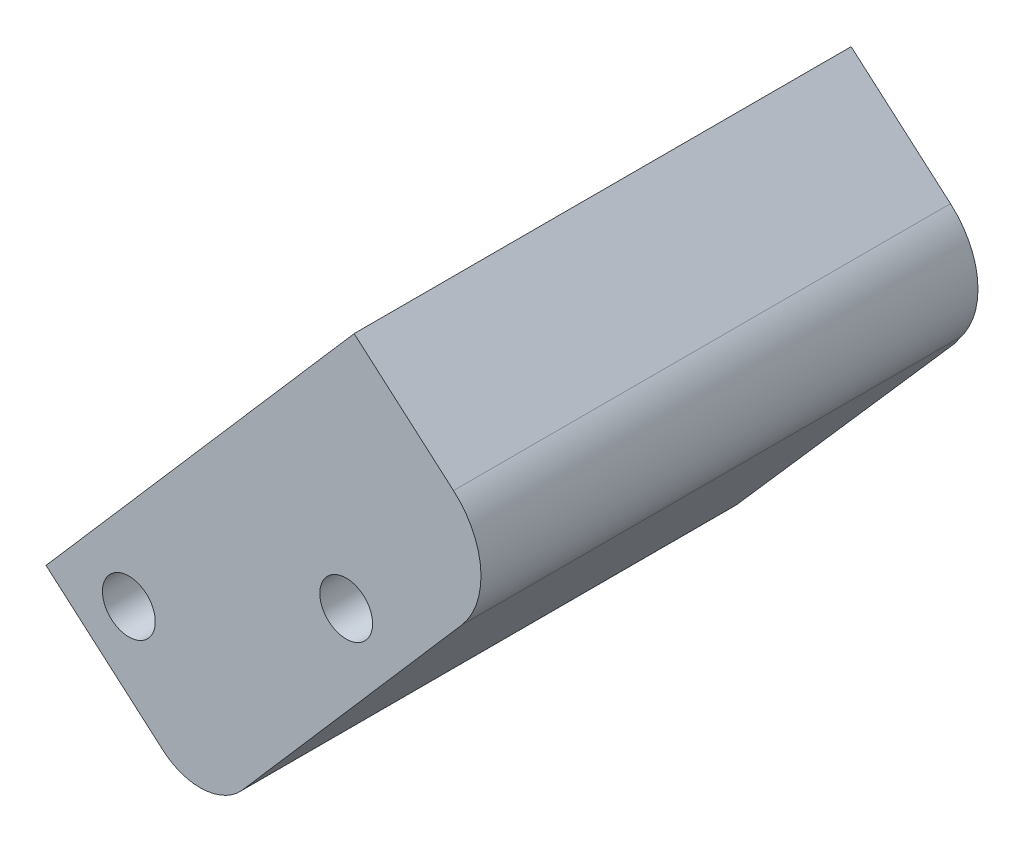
ISO-10303-21;
HEADER;
FILE_DESCRIPTION(('STEP AP214'),'2;1');
FILE_NAME('part.step','',(''),(''),'','','');
FILE_SCHEMA(('AUTOMOTIVE_DESIGN { 1 0 10303 214 1 1 1 1 }'));
ENDSEC;
DATA;
#1=APPLICATION_CONTEXT('core data for automotive mechanical design processes');
#2=APPLICATION_PROTOCOL_DEFINITION('international standard','automotive_design',2000,#1);
#3=PRODUCT_CONTEXT('',#1,'mechanical');
#4=PRODUCT('Part','Part','',(#3));
#5=PRODUCT_RELATED_PRODUCT_CATEGORY('part','',(#4));
#6=PRODUCT_DEFINITION_FORMATION('','',#4);
#7=PRODUCT_DEFINITION_CONTEXT('part definition',#1,'design');
#8=PRODUCT_DEFINITION('design','',#6,#7);
#9=PRODUCT_DEFINITION_SHAPE('','',#8);
#10=(LENGTH_UNIT() NAMED_UNIT(*) SI_UNIT(.MILLI.,.METRE.));
#11=(NAMED_UNIT(*) PLANE_ANGLE_UNIT() SI_UNIT($,.RADIAN.));
#12=(NAMED_UNIT(*) SI_UNIT($,.STERADIAN.) SOLID_ANGLE_UNIT());
#13=UNCERTAINTY_MEASURE_WITH_UNIT(LENGTH_MEASURE(1.E-05),#10,'distance_accuracy_value','');
#14=(GEOMETRIC_REPRESENTATION_CONTEXT(3) GLOBAL_UNCERTAINTY_ASSIGNED_CONTEXT((#13)) GLOBAL_UNIT_ASSIGNED_CONTEXT((#10,
#11,#12)) REPRESENTATION_CONTEXT('',''));
#15=CARTESIAN_POINT('',(0.,0.,0.));
#16=DIRECTION('',(0.,0.,1.));
#17=DIRECTION('',(1.,0.,0.));
#18=AXIS2_PLACEMENT_3D('',#15,#16,#17);
#19=CARTESIAN_POINT('',(-655.860193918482,-110.333995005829,2.10820000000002));
#20=DIRECTION('',(0.,0.,1.));
#21=DIRECTION('',(1.,0.,0.));
#22=AXIS2_PLACEMENT_3D('',#19,#20,#21);
#23=CYLINDRICAL_SURFACE('',#22,7.62000000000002);
#24=CARTESIAN_POINT('',(-655.860193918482,-110.333995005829,5.1571533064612));
#25=DIRECTION('',(-0.0343161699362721,-0.0395152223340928,-0.998629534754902));
#26=DIRECTION('',(-0.654791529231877,-0.753995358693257,0.052335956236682));
#27=AXIS2_PLACEMENT_3D('',#24,#25,#26);
#28=ELLIPSE('',#27,7.63045727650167,7.62000000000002);
#29=CARTESIAN_POINT('',(-650.106864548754,-115.330353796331,5.15715330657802));
#30=VERTEX_POINT('',#29);
#31=CARTESIAN_POINT('',(-660.856552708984,-116.087324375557,5.55650058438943));
#32=VERTEX_POINT('',#31);
#33=EDGE_CURVE('E447',#30,#32,#28,.T.);
#34=ORIENTED_EDGE('',*,*,#33,.F.);
#35=DIRECTION('',(0.,0.,1.));
#36=VECTOR('',#35,1.);
#37=CARTESIAN_POINT('',(-650.106864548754,-115.330353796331,2.10820000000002));
#38=LINE('',#37,#36);
#39=CARTESIAN_POINT('',(-650.106864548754,-115.330353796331,71.9582));
#40=VERTEX_POINT('',#39);
#41=EDGE_CURVE('E432',#30,#40,#38,.T.);
#42=ORIENTED_EDGE('',*,*,#41,.T.);
#43=CARTESIAN_POINT('',(-655.860193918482,-110.333995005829,71.9582));
#44=DIRECTION('',(0.,0.,-1.));
#45=DIRECTION('',(-1.,0.,0.));
#46=AXIS2_PLACEMENT_3D('',#43,#44,#45);
#47=CIRCLE('',#46,7.62000000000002);
#48=CARTESIAN_POINT('',(-660.856552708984,-116.087324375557,71.9582));
#49=VERTEX_POINT('',#48);
#50=EDGE_CURVE('E589',#40,#49,#47,.T.);
#51=ORIENTED_EDGE('',*,*,#50,.T.);
#52=DIRECTION('',(0.,0.,1.));
#53=VECTOR('',#52,1.);
#54=CARTESIAN_POINT('',(-660.856552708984,-116.087324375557,2.10820000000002));
#55=LINE('',#54,#53);
#56=EDGE_CURVE('E448',#32,#49,#55,.T.);
#57=ORIENTED_EDGE('',*,*,#56,.F.);
#58=EDGE_LOOP('',(#34,#42,#51,#57));
#59=FACE_BOUND('',#58,.T.);
#60=ADVANCED_FACE('F352',(#59),#23,.T.);
#61=CARTESIAN_POINT('',(-660.856552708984,-116.087324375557,2.10820000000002));
#62=DIRECTION('',(0.655690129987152,0.755030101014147,0.));
#63=DIRECTION('',(-0.755030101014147,0.655690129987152,0.));
#64=AXIS2_PLACEMENT_3D('',#61,#62,#63);
#65=PLANE('',#64);
#66=DIRECTION('',(-0.755030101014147,0.655690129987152,-1.53313777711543E-11));
#67=VECTOR('',#66,1.);
#68=CARTESIAN_POINT('',(-660.856552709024,-116.087324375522,5.55650058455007));
#69=LINE('',#68,#67);
#70=CARTESIAN_POINT('',(-676.678208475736,-102.347337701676,5.5565005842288));
#71=VERTEX_POINT('',#70);
#72=EDGE_CURVE('E369',#32,#71,#69,.T.);
#73=ORIENTED_EDGE('',*,*,#72,.F.);
#74=ORIENTED_EDGE('',*,*,#56,.T.);
#75=DIRECTION('',(-0.755030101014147,0.655690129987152,0.));
#76=VECTOR('',#75,1.);
#77=CARTESIAN_POINT('',(-660.856552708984,-116.087324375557,71.9582));
#78=LINE('',#77,#76);
#79=CARTESIAN_POINT('',(-676.678208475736,-102.347337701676,71.9582));
#80=VERTEX_POINT('',#79);
#81=EDGE_CURVE('E593',#49,#80,#78,.T.);
#82=ORIENTED_EDGE('',*,*,#81,.T.);
#83=DIRECTION('',(0.,0.,1.));
#84=VECTOR('',#83,1.);
#85=CARTESIAN_POINT('',(-676.678208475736,-102.347337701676,2.10820000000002));
#86=LINE('',#85,#84);
#87=EDGE_CURVE('E466',#71,#80,#86,.T.);
#88=ORIENTED_EDGE('',*,*,#87,.F.);
#89=EDGE_LOOP('',(#73,#74,#82,#88));
#90=FACE_BOUND('',#89,.T.);
#91=ADVANCED_FACE('F560',(#90),#65,.F.);
#92=CARTESIAN_POINT('',(-676.678208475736,-102.347337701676,2.10820000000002));
#93=DIRECTION('',(0.755030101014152,-0.655690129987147,0.));
#94=DIRECTION('',(0.655690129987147,0.755030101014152,0.));
#95=AXIS2_PLACEMENT_3D('',#92,#93,#94);
#96=PLANE('',#95);
#97=DIRECTION('',(0.655690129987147,0.755030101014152,-1.16867749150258E-12));
#98=VECTOR('',#97,1.);
#99=CARTESIAN_POINT('',(-676.678208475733,-102.347337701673,4.7998618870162));
#100=LINE('',#99,#98);
#101=CARTESIAN_POINT('',(-640.533059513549,-60.7260379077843,4.79986188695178));
#102=VERTEX_POINT('',#101);
#103=CARTESIAN_POINT('',(-635.041885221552,-54.4029262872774,4.79986188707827));
#104=VERTEX_POINT('',#103);
#105=EDGE_CURVE('E377',#102,#104,#100,.T.);
#106=ORIENTED_EDGE('',*,*,#105,.F.);
#107=CARTESIAN_POINT('',(-640.533059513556,-60.7260379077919,-3.89175347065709));
#108=DIRECTION('',(0.755030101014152,-0.655690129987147,0.));
#109=DIRECTION('',(0.655690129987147,0.755030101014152,0.));
#110=AXIS2_PLACEMENT_3D('',#107,#108,#109);
#111=CIRCLE('',#110,8.69161535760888);
#112=CARTESIAN_POINT('',(-642.959578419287,-63.5201852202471,3.97265523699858));
#113=VERTEX_POINT('',#112);
#114=EDGE_CURVE('E531',#113,#102,#111,.F.);
#115=ORIENTED_EDGE('',*,*,#114,.F.);
#116=DIRECTION('',(0.593286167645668,0.68317166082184,0.425779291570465));
#117=VECTOR('',#116,1.);
#118=CARTESIAN_POINT('',(-671.036403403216,-95.8507740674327,-16.1770318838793));
#119=LINE('',#118,#117);
#120=CARTESIAN_POINT('',(-644.301333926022,-65.0652226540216,3.00972749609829));
#121=VERTEX_POINT('',#120);
#122=EDGE_CURVE('E517',#121,#113,#119,.T.);
#123=ORIENTED_EDGE('',*,*,#122,.F.);
#124=CARTESIAN_POINT('',(-644.397717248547,-65.1762084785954,3.32210826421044));
#125=DIRECTION('',(0.755030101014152,-0.655690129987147,0.));
#126=DIRECTION('',(0.655690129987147,0.755030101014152,0.));
#127=AXIS2_PLACEMENT_3D('',#124,#125,#126);
#128=CIRCLE('',#127,0.345238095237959);
#129=CARTESIAN_POINT('',(-644.409564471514,-65.1898506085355,2.97734330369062));
#130=VERTEX_POINT('',#129);
#131=EDGE_CURVE('E513',#130,#121,#128,.T.);
#132=ORIENTED_EDGE('',*,*,#131,.F.);
#133=DIRECTION('',(0.654791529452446,0.753995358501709,-0.052335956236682));
#134=VECTOR('',#133,1.);
#135=CARTESIAN_POINT('',(-676.560038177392,-102.211264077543,5.54705550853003));
#136=LINE('',#135,#134);
#137=EDGE_CURVE('E510',#71,#130,#136,.T.);
#138=ORIENTED_EDGE('',*,*,#137,.F.);
#139=ORIENTED_EDGE('',*,*,#87,.T.);
#140=DIRECTION('',(0.655690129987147,0.755030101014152,0.));
#141=VECTOR('',#140,1.);
#142=CARTESIAN_POINT('',(-676.678208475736,-102.347337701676,71.9582));
#143=LINE('',#142,#141);
#144=CARTESIAN_POINT('',(-635.041885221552,-54.4029262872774,71.9582));
#145=VERTEX_POINT('',#144);
#146=EDGE_CURVE('E583',#80,#145,#143,.T.);
#147=ORIENTED_EDGE('',*,*,#146,.T.);
#148=DIRECTION('',(0.,0.,1.));
#149=VECTOR('',#148,1.);
#150=CARTESIAN_POINT('',(-635.041885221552,-54.4029262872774,2.10820000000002));
#151=LINE('',#150,#149);
#152=EDGE_CURVE('E578',#104,#145,#151,.T.);
#153=ORIENTED_EDGE('',*,*,#152,.F.);
#154=EDGE_LOOP('',(#106,#115,#123,#132,#138,#139,#147,#153));
#155=FACE_BOUND('',#154,.T.);
#156=ADVANCED_FACE('F565',(#155),#96,.F.);
#157=CARTESIAN_POINT('',(-635.041885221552,-54.4029262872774,2.10820000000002));
#158=DIRECTION('',(-0.655690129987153,-0.755030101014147,0.));
#159=DIRECTION('',(0.755030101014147,-0.655690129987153,0.));
#160=AXIS2_PLACEMENT_3D('',#157,#158,#159);
#161=PLANE('',#160);
#162=DIRECTION('',(0.755030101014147,-0.655690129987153,1.53299111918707E-11));
#163=VECTOR('',#162,1.);
#164=CARTESIAN_POINT('',(-635.041885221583,-54.4029262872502,4.79986188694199));
#165=LINE('',#164,#163);
#166=CARTESIAN_POINT('',(-621.61745002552,-66.0610967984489,4.79986188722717));
#167=VERTEX_POINT('',#166);
#168=EDGE_CURVE('E576',#104,#167,#165,.T.);
#169=ORIENTED_EDGE('',*,*,#168,.F.);
#170=ORIENTED_EDGE('',*,*,#152,.T.);
#171=DIRECTION('',(0.755030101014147,-0.655690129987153,0.));
#172=VECTOR('',#171,1.);
#173=CARTESIAN_POINT('',(-635.041885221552,-54.4029262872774,71.9582));
#174=LINE('',#173,#172);
#175=CARTESIAN_POINT('',(-621.61745002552,-66.0610967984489,71.9582));
#176=VERTEX_POINT('',#175);
#177=EDGE_CURVE('E601',#145,#176,#174,.T.);
#178=ORIENTED_EDGE('',*,*,#177,.T.);
#179=DIRECTION('',(0.,0.,1.));
#180=VECTOR('',#179,1.);
#181=CARTESIAN_POINT('',(-621.61745002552,-66.0610967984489,2.10820000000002));
#182=LINE('',#181,#180);
#183=EDGE_CURVE('E580',#167,#176,#182,.T.);
#184=ORIENTED_EDGE('',*,*,#183,.F.);
#185=EDGE_LOOP('',(#169,#170,#178,#184));
#186=FACE_BOUND('',#185,.T.);
#187=ADVANCED_FACE('F557',(#186),#161,.F.);
#188=CARTESIAN_POINT('',(-628.695624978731,-74.2116467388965,2.10820000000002));
#189=DIRECTION('',(0.,0.,1.));
#190=DIRECTION('',(1.,0.,0.));
#191=AXIS2_PLACEMENT_3D('',#188,#189,#190);
#192=CYLINDRICAL_SURFACE('',#191,10.795);
#193=CARTESIAN_POINT('',(-628.695624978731,-74.2116467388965,4.79986188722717));
#194=DIRECTION('',(1.08082540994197E-11,-1.09340581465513E-11,-1.));
#195=DIRECTION('',(0.,1.,-1.09340581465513E-11));
#196=AXIS2_PLACEMENT_3D('',#193,#194,#195);
#197=CIRCLE('',#196,10.795);
#198=CARTESIAN_POINT('',(-619.165581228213,-79.2821783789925,4.79986188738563));
#199=VERTEX_POINT('',#198);
#200=EDGE_CURVE('E61',#167,#199,#197,.T.);
#201=ORIENTED_EDGE('',*,*,#200,.F.);
#202=ORIENTED_EDGE('',*,*,#183,.T.);
#203=CARTESIAN_POINT('',(-628.695624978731,-74.2116467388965,71.9582));
#204=DIRECTION('',(0.,0.,-1.));
#205=DIRECTION('',(-1.,0.,0.));
#206=AXIS2_PLACEMENT_3D('',#203,#204,#205);
#207=CIRCLE('',#206,10.795);
#208=CARTESIAN_POINT('',(-620.545075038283,-81.2898216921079,71.9582));
#209=VERTEX_POINT('',#208);
#210=EDGE_CURVE('E604',#176,#209,#207,.T.);
#211=ORIENTED_EDGE('',*,*,#210,.T.);
#212=DIRECTION('',(0.,0.,1.));
#213=VECTOR('',#212,1.);
#214=CARTESIAN_POINT('',(-620.545075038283,-81.2898216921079,2.10820000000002));
#215=LINE('',#214,#213);
#216=CARTESIAN_POINT('',(-620.545075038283,-81.2898216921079,4.45606514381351));
#217=VERTEX_POINT('',#216);
#218=EDGE_CURVE('E444',#217,#209,#215,.T.);
#219=ORIENTED_EDGE('',*,*,#218,.F.);
#220=CARTESIAN_POINT('',(-619.165581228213,-79.2821783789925,4.79986188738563));
#221=CARTESIAN_POINT('',(-619.262746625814,-79.4648993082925,4.79990608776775));
#222=CARTESIAN_POINT('',(-619.365255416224,-79.6447957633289,4.79284251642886));
#223=CARTESIAN_POINT('',(-619.578985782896,-79.996161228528,4.76437839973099));
#224=CARTESIAN_POINT('',(-619.690130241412,-80.1676866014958,4.74309419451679));
#225=CARTESIAN_POINT('',(-619.920764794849,-80.5025280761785,4.68607476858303));
#226=CARTESIAN_POINT('',(-620.040254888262,-80.6658441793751,4.65033955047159));
#227=CARTESIAN_POINT('',(-620.2872052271,-80.9845118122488,4.56422919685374));
#228=CARTESIAN_POINT('',(-620.414722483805,-81.1397875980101,4.51373713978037));
#229=CARTESIAN_POINT('',(-620.545075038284,-81.2898216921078,4.4560651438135));
#230=B_SPLINE_CURVE_WITH_KNOTS('',3,(#220,#221,#222,#223,#224,#225,#226,#227,#228,#229),
.UNSPECIFIED.,.F.,.F.,(4,2,2,2,4),(0.,0.620662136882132,1.23630776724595,1.85195328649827,
2.47261543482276),.UNSPECIFIED.);
#231=EDGE_CURVE('E521',#199,#217,#230,.T.);
#232=ORIENTED_EDGE('',*,*,#231,.F.);
#233=EDGE_LOOP('',(#201,#202,#211,#219,#232));
#234=FACE_BOUND('',#233,.T.);
#235=ADVANCED_FACE('F533',(#234),#192,.T.);
#236=CARTESIAN_POINT('',(-650.106864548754,-115.330353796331,2.10820000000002));
#237=DIRECTION('',(-0.755030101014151,0.655690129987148,0.));
#238=DIRECTION('',(-0.655690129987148,-0.755030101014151,0.));
#239=AXIS2_PLACEMENT_3D('',#236,#237,#238);
#240=PLANE('',#239);
#241=CARTESIAN_POINT('',(-618.958074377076,-79.4623833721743,-3.89175347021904));
#242=DIRECTION('',(-0.755030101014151,0.655690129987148,0.));
#243=DIRECTION('',(-0.655690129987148,-0.755030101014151,0.));
#244=AXIS2_PLACEMENT_3D('',#241,#242,#243);
#245=CIRCLE('',#244,8.69161535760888);
#246=CARTESIAN_POINT('',(-621.384593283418,-82.2565306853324,3.97265523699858));
#247=VERTEX_POINT('',#246);
#248=EDGE_CURVE('E361',#217,#247,#245,.F.);
#249=ORIENTED_EDGE('',*,*,#248,.F.);
#250=ORIENTED_EDGE('',*,*,#218,.T.);
#251=DIRECTION('',(-0.655690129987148,-0.755030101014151,0.));
#252=VECTOR('',#251,1.);
#253=CARTESIAN_POINT('',(-650.106864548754,-115.330353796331,71.9582));
#254=LINE('',#253,#252);
#255=EDGE_CURVE('E439',#209,#40,#254,.T.);
#256=ORIENTED_EDGE('',*,*,#255,.T.);
#257=ORIENTED_EDGE('',*,*,#41,.F.);
#258=DIRECTION('',(-0.654791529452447,-0.753995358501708,0.052335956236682));
#259=VECTOR('',#258,1.);
#260=CARTESIAN_POINT('',(-650.002379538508,-115.210038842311,5.14880206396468));
#261=LINE('',#260,#259);
#262=CARTESIAN_POINT('',(-622.834579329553,-83.9261960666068,2.97734330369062));
#263=VERTEX_POINT('',#262);
#264=EDGE_CURVE('E436',#263,#30,#261,.T.);
#265=ORIENTED_EDGE('',*,*,#264,.F.);
#266=CARTESIAN_POINT('',(-622.822732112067,-83.9125539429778,3.32210826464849));
#267=DIRECTION('',(-0.755030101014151,0.655690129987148,0.));
#268=DIRECTION('',(-0.655690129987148,-0.755030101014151,0.));
#269=AXIS2_PLACEMENT_3D('',#266,#267,#268);
#270=CIRCLE('',#269,0.345238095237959);
#271=CARTESIAN_POINT('',(-622.726348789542,-83.8015681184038,3.00972749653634));
#272=VERTEX_POINT('',#271);
#273=EDGE_CURVE('E459',#272,#263,#270,.T.);
#274=ORIENTED_EDGE('',*,*,#273,.F.);
#275=DIRECTION('',(-0.593286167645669,-0.683171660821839,-0.425779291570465));
#276=VECTOR('',#275,1.);
#277=CARTESIAN_POINT('',(-645.37083939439,-109.87679976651,-13.2413764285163));
#278=LINE('',#277,#276);
#279=EDGE_CURVE('E464',#247,#272,#278,.T.);
#280=ORIENTED_EDGE('',*,*,#279,.F.);
#281=EDGE_LOOP('',(#249,#250,#256,#257,#265,#274,#280));
#282=FACE_BOUND('',#281,.T.);
#283=ADVANCED_FACE('F434',(#282),#240,.F.);
#284=CARTESIAN_POINT('',(-655.860193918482,-110.333995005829,71.9582));
#285=DIRECTION('',(0.,0.,-1.));
#286=DIRECTION('',(-1.,0.,0.));
#287=AXIS2_PLACEMENT_3D('',#284,#285,#286);
#288=PLANE('',#287);
#289=CARTESIAN_POINT('',(-665.480616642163,-101.558826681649,71.9582));
#290=DIRECTION('',(0.,0.,-1.));
#291=DIRECTION('',(-1.,0.,0.));
#292=AXIS2_PLACEMENT_3D('',#289,#290,#291);
#293=CIRCLE('',#292,3.56869999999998);
#294=CARTESIAN_POINT('',(-669.049316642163,-101.558826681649,71.9582));
#295=VERTEX_POINT('',#294);
#296=EDGE_CURVE('E673',#295,#295,#293,.T.);
#297=ORIENTED_EDGE('',*,*,#296,.T.);
#298=EDGE_LOOP('',(#297));
#299=FACE_BOUND('',#298,.T.);
#300=CARTESIAN_POINT('',(-636.114480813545,-87.1124959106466,71.9582));
#301=DIRECTION('',(0.,0.,-1.));
#302=DIRECTION('',(-1.,0.,0.));
#303=AXIS2_PLACEMENT_3D('',#300,#301,#302);
#304=CIRCLE('',#303,3.56869999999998);
#305=CARTESIAN_POINT('',(-639.683180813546,-87.1124959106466,71.9582));
#306=VERTEX_POINT('',#305);
#307=EDGE_CURVE('E494',#306,#306,#304,.T.);
#308=ORIENTED_EDGE('',*,*,#307,.T.);
#309=EDGE_LOOP('',(#308));
#310=FACE_BOUND('',#309,.T.);
#311=ORIENTED_EDGE('',*,*,#50,.F.);
#312=ORIENTED_EDGE('',*,*,#255,.F.);
#313=ORIENTED_EDGE('',*,*,#210,.F.);
#314=ORIENTED_EDGE('',*,*,#177,.F.);
#315=ORIENTED_EDGE('',*,*,#146,.F.);
#316=ORIENTED_EDGE('',*,*,#81,.F.);
#317=EDGE_LOOP('',(#311,#312,#313,#314,#315,#316));
#318=FACE_BOUND('',#317,.T.);
#319=ADVANCED_FACE('F548',(#299,#310,#318),#288,.F.);
#320=CARTESIAN_POINT('',(-743.601021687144,28.7811823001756,4.79986188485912));
#321=DIRECTION('',(1.08082540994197E-11,-1.09340581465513E-11,-1.));
#322=DIRECTION('',(0.,1.,-1.09340581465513E-11));
#323=AXIS2_PLACEMENT_3D('',#320,#321,#322);
#324=PLANE('',#323);
#325=DIRECTION('',(0.755030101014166,-0.655690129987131,1.53299111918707E-11));
#326=VECTOR('',#325,1.);
#327=CARTESIAN_POINT('',(-743.601021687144,28.7811823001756,4.79986188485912));
#328=LINE('',#327,#326);
#329=EDGE_CURVE('E451',#102,#199,#328,.T.);
#330=ORIENTED_EDGE('',*,*,#329,.F.);
#331=ORIENTED_EDGE('',*,*,#105,.T.);
#332=ORIENTED_EDGE('',*,*,#168,.T.);
#333=ORIENTED_EDGE('',*,*,#200,.T.);
#334=EDGE_LOOP('',(#330,#331,#332,#333));
#335=FACE_BOUND('',#334,.T.);
#336=ADVANCED_FACE('F543',(#335),#324,.T.);
#337=CARTESIAN_POINT('',(-743.60102168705,28.7811823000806,-3.89175347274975));
#338=DIRECTION('',(0.755030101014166,-0.655690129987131,1.53299111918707E-11));
#339=DIRECTION('',(0.655690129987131,0.755030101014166,0.));
#340=AXIS2_PLACEMENT_3D('',#337,#338,#339);
#341=CYLINDRICAL_SURFACE('',#340,8.69161535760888);
#342=DIRECTION('',(0.755030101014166,-0.655690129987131,1.53299111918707E-11));
#343=VECTOR('',#342,1.);
#344=CARTESIAN_POINT('',(-746.027540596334,25.9870349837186,3.97265523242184));
#345=LINE('',#344,#343);
#346=EDGE_CURVE('E501',#113,#247,#345,.T.);
#347=ORIENTED_EDGE('',*,*,#346,.F.);
#348=ORIENTED_EDGE('',*,*,#114,.T.);
#349=ORIENTED_EDGE('',*,*,#329,.T.);
#350=ORIENTED_EDGE('',*,*,#231,.T.);
#351=ORIENTED_EDGE('',*,*,#248,.T.);
#352=EDGE_LOOP('',(#347,#348,#349,#350,#351));
#353=FACE_BOUND('',#352,.T.);
#354=ADVANCED_FACE('F537',(#353),#341,.F.);
#355=CARTESIAN_POINT('',(-747.369296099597,24.4419975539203,3.00972749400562));
#356=DIRECTION('',(0.27917927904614,0.321476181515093,-0.904827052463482));
#357=DIRECTION('',(0.,0.942293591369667,0.334787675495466));
#358=AXIS2_PLACEMENT_3D('',#355,#356,#357);
#359=PLANE('',#358);
#360=DIRECTION('',(0.755030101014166,-0.655690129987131,1.53299111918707E-11));
#361=VECTOR('',#360,1.);
#362=CARTESIAN_POINT('',(-747.369296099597,24.4419975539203,3.00972749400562));
#363=LINE('',#362,#361);
#364=EDGE_CURVE('E484',#121,#272,#363,.T.);
#365=ORIENTED_EDGE('',*,*,#364,.F.);
#366=ORIENTED_EDGE('',*,*,#122,.T.);
#367=ORIENTED_EDGE('',*,*,#346,.T.);
#368=ORIENTED_EDGE('',*,*,#279,.T.);
#369=EDGE_LOOP('',(#365,#366,#367,#368));
#370=FACE_BOUND('',#369,.T.);
#371=ADVANCED_FACE('F542',(#370),#359,.T.);
#372=CARTESIAN_POINT('',(-747.465679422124,24.3310117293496,3.32210826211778));
#373=DIRECTION('',(0.755030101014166,-0.655690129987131,1.53299111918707E-11));
#374=DIRECTION('',(0.655690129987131,0.755030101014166,0.));
#375=AXIS2_PLACEMENT_3D('',#372,#373,#374);
#376=CYLINDRICAL_SURFACE('',#375,0.345238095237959);
#377=DIRECTION('',(0.755030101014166,-0.655690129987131,1.53299111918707E-11));
#378=VECTOR('',#377,1.);
#379=CARTESIAN_POINT('',(-747.477526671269,24.3173695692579,2.97734330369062));
#380=LINE('',#379,#378);
#381=EDGE_CURVE('E457',#130,#263,#380,.T.);
#382=ORIENTED_EDGE('',*,*,#381,.F.);
#383=ORIENTED_EDGE('',*,*,#131,.T.);
#384=ORIENTED_EDGE('',*,*,#364,.T.);
#385=ORIENTED_EDGE('',*,*,#273,.T.);
#386=EDGE_LOOP('',(#382,#383,#384,#385));
#387=FACE_BOUND('',#386,.T.);
#388=ADVANCED_FACE('F636',(#387),#376,.T.);
#389=CARTESIAN_POINT('',(-747.477526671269,24.3173695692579,2.97734330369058));
#390=DIRECTION('',(-0.0343161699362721,-0.0395152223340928,-0.998629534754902));
#391=DIRECTION('',(0.,0.999218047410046,-0.0395385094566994));
#392=AXIS2_PLACEMENT_3D('',#389,#390,#391);
#393=PLANE('',#392);
#394=CARTESIAN_POINT('',(-665.480616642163,-101.558826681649,5.14051383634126));
#395=DIRECTION('',(-0.0343161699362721,-0.0395152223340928,-0.998629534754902));
#396=DIRECTION('',(0.654791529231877,0.753995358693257,-0.052335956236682));
#397=AXIS2_PLACEMENT_3D('',#394,#395,#396);
#398=ELLIPSE('',#397,5.36675495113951,5.35940000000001);
#399=CARTESIAN_POINT('',(-661.966510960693,-97.5123183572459,4.85963958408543));
#400=VERTEX_POINT('',#399);
#401=EDGE_CURVE('E355',#400,#400,#398,.T.);
#402=ORIENTED_EDGE('',*,*,#401,.F.);
#403=EDGE_LOOP('',(#402));
#404=FACE_BOUND('',#403,.T.);
#405=CARTESIAN_POINT('',(-636.114480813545,-87.1124959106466,3.55976419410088));
#406=DIRECTION('',(-0.0343161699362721,-0.0395152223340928,-0.998629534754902));
#407=DIRECTION('',(0.654791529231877,0.753995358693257,-0.052335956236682));
#408=AXIS2_PLACEMENT_3D('',#405,#406,#407);
#409=ELLIPSE('',#408,5.36675495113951,5.35940000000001);
#410=CARTESIAN_POINT('',(-632.600375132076,-83.0659875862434,3.27888994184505));
#411=VERTEX_POINT('',#410);
#412=EDGE_CURVE('E475',#411,#411,#409,.T.);
#413=ORIENTED_EDGE('',*,*,#412,.F.);
#414=EDGE_LOOP('',(#413));
#415=FACE_BOUND('',#414,.T.);
#416=ORIENTED_EDGE('',*,*,#72,.T.);
#417=ORIENTED_EDGE('',*,*,#137,.T.);
#418=ORIENTED_EDGE('',*,*,#381,.T.);
#419=ORIENTED_EDGE('',*,*,#264,.T.);
#420=ORIENTED_EDGE('',*,*,#33,.T.);
#421=EDGE_LOOP('',(#416,#417,#418,#419,#420));
#422=FACE_BOUND('',#421,.T.);
#423=ADVANCED_FACE('F454',(#404,#415,#422),#393,.T.);
#424=CARTESIAN_POINT('',(-636.114480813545,-87.1124959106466,2.10820000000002));
#425=DIRECTION('',(0.,0.,-1.));
#426=DIRECTION('',(-1.,0.,0.));
#427=AXIS2_PLACEMENT_3D('',#424,#425,#426);
#428=CYLINDRICAL_SURFACE('',#427,5.35940000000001);
#429=ORIENTED_EDGE('',*,*,#412,.T.);
#430=EDGE_LOOP('',(#429));
#431=FACE_BOUND('',#430,.T.);
#432=CARTESIAN_POINT('',(-636.114480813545,-87.1124959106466,18.1102));
#433=DIRECTION('',(0.,0.,-1.));
#434=DIRECTION('',(-1.,0.,0.));
#435=AXIS2_PLACEMENT_3D('',#432,#433,#434);
#436=CIRCLE('',#435,5.35940000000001);
#437=CARTESIAN_POINT('',(-641.473880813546,-87.1124959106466,18.1102));
#438=VERTEX_POINT('',#437);
#439=EDGE_CURVE('E478',#438,#438,#436,.T.);
#440=ORIENTED_EDGE('',*,*,#439,.F.);
#441=EDGE_LOOP('',(#440));
#442=FACE_BOUND('',#441,.T.);
#443=ADVANCED_FACE('F643',(#431,#442),#428,.F.);
#444=CARTESIAN_POINT('',(-632.545780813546,-87.1124959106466,18.1102));
#445=DIRECTION('',(0.,0.,1.));
#446=DIRECTION('',(1.,0.,0.));
#447=AXIS2_PLACEMENT_3D('',#444,#445,#446);
#448=PLANE('',#447);
#449=CARTESIAN_POINT('',(-636.114480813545,-87.1124959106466,18.1102));
#450=DIRECTION('',(0.,0.,-1.));
#451=DIRECTION('',(-1.,0.,0.));
#452=AXIS2_PLACEMENT_3D('',#449,#450,#451);
#453=CIRCLE('',#452,3.56869999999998);
#454=CARTESIAN_POINT('',(-639.683180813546,-87.1124959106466,18.1102));
#455=VERTEX_POINT('',#454);
#456=EDGE_CURVE('E487',#455,#455,#453,.T.);
#457=ORIENTED_EDGE('',*,*,#456,.F.);
#458=EDGE_LOOP('',(#457));
#459=FACE_BOUND('',#458,.T.);
#460=ORIENTED_EDGE('',*,*,#439,.T.);
#461=EDGE_LOOP('',(#460));
#462=FACE_BOUND('',#461,.T.);
#463=ADVANCED_FACE('F649',(#459,#462),#448,.F.);
#464=CARTESIAN_POINT('',(-636.114480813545,-87.1124959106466,2.10820000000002));
#465=DIRECTION('',(0.,0.,-1.));
#466=DIRECTION('',(-1.,0.,0.));
#467=AXIS2_PLACEMENT_3D('',#464,#465,#466);
#468=CYLINDRICAL_SURFACE('',#467,3.56869999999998);
#469=ORIENTED_EDGE('',*,*,#307,.F.);
#470=EDGE_LOOP('',(#469));
#471=FACE_BOUND('',#470,.T.);
#472=ORIENTED_EDGE('',*,*,#456,.T.);
#473=EDGE_LOOP('',(#472));
#474=FACE_BOUND('',#473,.T.);
#475=ADVANCED_FACE('F652',(#471,#474),#468,.F.);
#476=CARTESIAN_POINT('',(-665.480616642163,-101.558826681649,2.10820000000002));
#477=DIRECTION('',(0.,0.,-1.));
#478=DIRECTION('',(-1.,0.,0.));
#479=AXIS2_PLACEMENT_3D('',#476,#477,#478);
#480=CYLINDRICAL_SURFACE('',#479,5.35940000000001);
#481=ORIENTED_EDGE('',*,*,#401,.T.);
#482=EDGE_LOOP('',(#481));
#483=FACE_BOUND('',#482,.T.);
#484=CARTESIAN_POINT('',(-665.480616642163,-101.558826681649,18.1102));
#485=DIRECTION('',(0.,0.,-1.));
#486=DIRECTION('',(-1.,0.,0.));
#487=AXIS2_PLACEMENT_3D('',#484,#485,#486);
#488=CIRCLE('',#487,5.35940000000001);
#489=CARTESIAN_POINT('',(-670.840016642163,-101.558826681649,18.1102));
#490=VERTEX_POINT('',#489);
#491=EDGE_CURVE('E678',#490,#490,#488,.T.);
#492=ORIENTED_EDGE('',*,*,#491,.F.);
#493=EDGE_LOOP('',(#492));
#494=FACE_BOUND('',#493,.T.);
#495=ADVANCED_FACE('F656',(#483,#494),#480,.F.);
#496=CARTESIAN_POINT('',(-661.911916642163,-101.558826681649,18.1102));
#497=DIRECTION('',(0.,0.,1.));
#498=DIRECTION('',(1.,0.,0.));
#499=AXIS2_PLACEMENT_3D('',#496,#497,#498);
#500=PLANE('',#499);
#501=CARTESIAN_POINT('',(-665.480616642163,-101.558826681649,18.1102));
#502=DIRECTION('',(0.,0.,-1.));
#503=DIRECTION('',(-1.,0.,0.));
#504=AXIS2_PLACEMENT_3D('',#501,#502,#503);
#505=CIRCLE('',#504,3.56869999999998);
#506=CARTESIAN_POINT('',(-669.049316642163,-101.558826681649,18.1102));
#507=VERTEX_POINT('',#506);
#508=EDGE_CURVE('E676',#507,#507,#505,.T.);
#509=ORIENTED_EDGE('',*,*,#508,.F.);
#510=EDGE_LOOP('',(#509));
#511=FACE_BOUND('',#510,.T.);
#512=ORIENTED_EDGE('',*,*,#491,.T.);
#513=EDGE_LOOP('',(#512));
#514=FACE_BOUND('',#513,.T.);
#515=ADVANCED_FACE('F660',(#511,#514),#500,.F.);
#516=CARTESIAN_POINT('',(-665.480616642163,-101.558826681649,2.10820000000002));
#517=DIRECTION('',(0.,0.,-1.));
#518=DIRECTION('',(-1.,0.,0.));
#519=AXIS2_PLACEMENT_3D('',#516,#517,#518);
#520=CYLINDRICAL_SURFACE('',#519,3.56869999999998);
#521=ORIENTED_EDGE('',*,*,#296,.F.);
#522=EDGE_LOOP('',(#521));
#523=FACE_BOUND('',#522,.T.);
#524=ORIENTED_EDGE('',*,*,#508,.T.);
#525=EDGE_LOOP('',(#524));
#526=FACE_BOUND('',#525,.T.);
#527=ADVANCED_FACE('F664',(#523,#526),#520,.F.);
#528=CLOSED_SHELL('',(#60,#91,#156,#187,#235,#283,#319,#336,#354,#371,#388,#423,#443,#463,#475,
#495,#515,#527));
#529=MANIFOLD_SOLID_BREP('B6',#528);
#530=ADVANCED_BREP_SHAPE_REPRESENTATION('',(#18,#529),#14);
#531=SHAPE_DEFINITION_REPRESENTATION(#9,#530);
ENDSEC;
END-ISO-10303-21;
